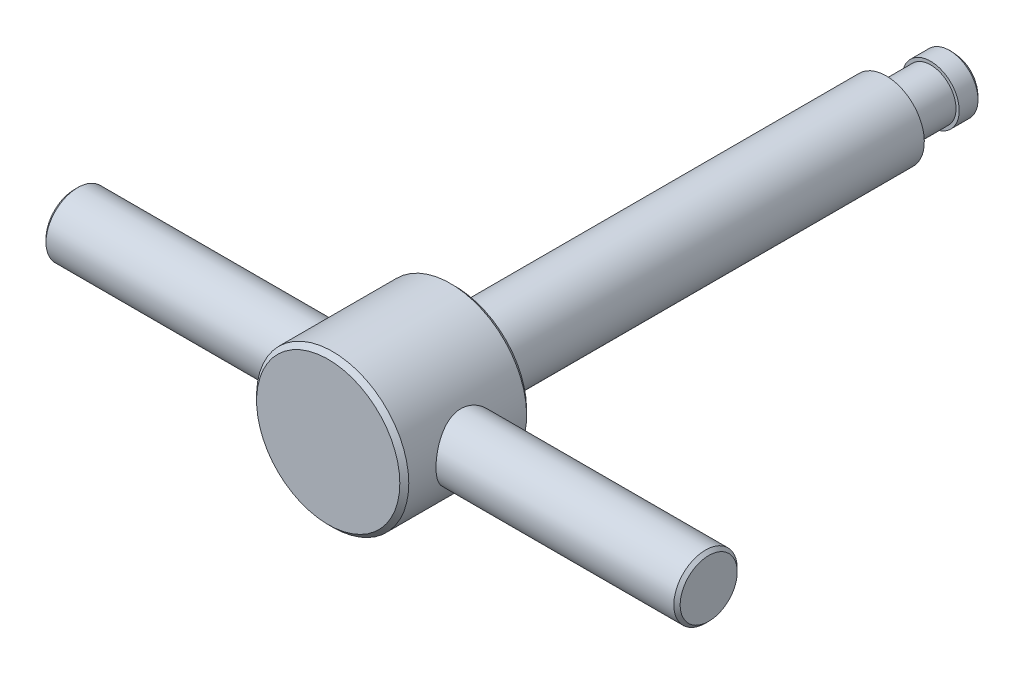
ISO-10303-21;
HEADER;
FILE_DESCRIPTION(('STEP AP214'),'2;1');
FILE_NAME('part.step','',(''),(''),'','','');
FILE_SCHEMA(('AUTOMOTIVE_DESIGN { 1 0 10303 214 1 1 1 1 }'));
ENDSEC;
DATA;
#1=APPLICATION_CONTEXT('core data for automotive mechanical design processes');
#2=APPLICATION_PROTOCOL_DEFINITION('international standard','automotive_design',2000,#1);
#3=PRODUCT_CONTEXT('',#1,'mechanical');
#4=PRODUCT('Part','Part','',(#3));
#5=PRODUCT_RELATED_PRODUCT_CATEGORY('part','',(#4));
#6=PRODUCT_DEFINITION_FORMATION('','',#4);
#7=PRODUCT_DEFINITION_CONTEXT('part definition',#1,'design');
#8=PRODUCT_DEFINITION('design','',#6,#7);
#9=PRODUCT_DEFINITION_SHAPE('','',#8);
#10=(LENGTH_UNIT() NAMED_UNIT(*) SI_UNIT(.MILLI.,.METRE.));
#11=(NAMED_UNIT(*) PLANE_ANGLE_UNIT() SI_UNIT($,.RADIAN.));
#12=(NAMED_UNIT(*) SI_UNIT($,.STERADIAN.) SOLID_ANGLE_UNIT());
#13=UNCERTAINTY_MEASURE_WITH_UNIT(LENGTH_MEASURE(1.E-05),#10,'distance_accuracy_value','');
#14=(GEOMETRIC_REPRESENTATION_CONTEXT(3) GLOBAL_UNCERTAINTY_ASSIGNED_CONTEXT((#13)) GLOBAL_UNIT_ASSIGNED_CONTEXT((#10,
#11,#12)) REPRESENTATION_CONTEXT('',''));
#15=CARTESIAN_POINT('',(0.,0.,0.));
#16=DIRECTION('',(0.,0.,1.));
#17=DIRECTION('',(1.,0.,0.));
#18=AXIS2_PLACEMENT_3D('',#15,#16,#17);
#19=CARTESIAN_POINT('',(25.,0.,47.25));
#20=DIRECTION('',(-1.,0.,0.));
#21=DIRECTION('',(0.,-1.,0.));
#22=AXIS2_PLACEMENT_3D('',#19,#20,#21);
#23=PLANE('',#22);
#24=CARTESIAN_POINT('',(25.0000000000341,0.,45.));
#25=DIRECTION('',(-1.,0.,0.));
#26=DIRECTION('',(0.,-1.,0.));
#27=AXIS2_PLACEMENT_3D('',#24,#25,#26);
#28=CIRCLE('',#27,2.25000000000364);
#29=CARTESIAN_POINT('',(25.0000000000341,-2.25000000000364,45.));
#30=VERTEX_POINT('',#29);
#31=EDGE_CURVE('E15',#30,#30,#28,.T.);
#32=ORIENTED_EDGE('',*,*,#31,.F.);
#33=EDGE_LOOP('',(#32));
#34=FACE_BOUND('',#33,.T.);
#35=ADVANCED_FACE('F12',(#34),#23,.F.);
#36=CARTESIAN_POINT('',(-25.,0.,45.));
#37=DIRECTION('',(1.,0.,0.));
#38=DIRECTION('',(0.,1.,0.));
#39=AXIS2_PLACEMENT_3D('',#36,#37,#38);
#40=PLANE('',#39);
#41=CARTESIAN_POINT('',(-24.9999999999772,0.,45.));
#42=DIRECTION('',(1.,0.,0.));
#43=DIRECTION('',(0.,0.,1.));
#44=AXIS2_PLACEMENT_3D('',#41,#42,#43);
#45=CIRCLE('',#44,2.25000000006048);
#46=CARTESIAN_POINT('',(-24.9999999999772,0.,47.2500000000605));
#47=VERTEX_POINT('',#46);
#48=EDGE_CURVE('E133',#47,#47,#45,.T.);
#49=ORIENTED_EDGE('',*,*,#48,.F.);
#50=EDGE_LOOP('',(#49));
#51=FACE_BOUND('',#50,.T.);
#52=ADVANCED_FACE('F171',(#51),#40,.F.);
#53=CARTESIAN_POINT('',(0.,0.,3.));
#54=DIRECTION('',(-1.,0.,0.));
#55=DIRECTION('',(0.,1.,0.));
#56=AXIS2_PLACEMENT_3D('',#53,#54,#55);
#57=SPHERICAL_SURFACE('',#56,3.);
#58=CARTESIAN_POINT('',(0.,0.,1.01568651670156));
#59=DIRECTION('',(0.,0.,1.));
#60=DIRECTION('',(0.,-1.,0.));
#61=AXIS2_PLACEMENT_3D('',#58,#59,#60);
#62=CIRCLE('',#61,2.25);
#63=CARTESIAN_POINT('',(0.,-2.25,1.01568651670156));
#64=VERTEX_POINT('',#63);
#65=EDGE_CURVE('E126',#64,#64,#62,.T.);
#66=ORIENTED_EDGE('',*,*,#65,.F.);
#67=EDGE_LOOP('',(#66));
#68=FACE_BOUND('',#67,.T.);
#69=ADVANCED_FACE('F168',(#68),#57,.T.);
#70=CARTESIAN_POINT('',(24.7499999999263,0.,45.));
#71=DIRECTION('',(-1.,0.,0.));
#72=DIRECTION('',(0.,-1.,0.));
#73=AXIS2_PLACEMENT_3D('',#70,#71,#72);
#74=CONICAL_SURFACE('',#73,2.50000000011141,0.785398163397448);
#75=CARTESIAN_POINT('',(24.75,0.,45.));
#76=DIRECTION('',(-1.,0.,0.));
#77=DIRECTION('',(0.,-1.,0.));
#78=AXIS2_PLACEMENT_3D('',#75,#76,#77);
#79=CIRCLE('',#78,2.5);
#80=CARTESIAN_POINT('',(24.75,-2.5,45.));
#81=VERTEX_POINT('',#80);
#82=EDGE_CURVE('E124',#81,#81,#79,.T.);
#83=ORIENTED_EDGE('',*,*,#82,.F.);
#84=EDGE_LOOP('',(#83));
#85=FACE_BOUND('',#84,.T.);
#86=ORIENTED_EDGE('',*,*,#31,.T.);
#87=EDGE_LOOP('',(#86));
#88=FACE_BOUND('',#87,.T.);
#89=ADVANCED_FACE('F164',(#85,#88),#74,.T.);
#90=CARTESIAN_POINT('',(0.,0.,50.));
#91=DIRECTION('',(0.,0.,-1.));
#92=DIRECTION('',(0.,1.,0.));
#93=AXIS2_PLACEMENT_3D('',#90,#91,#92);
#94=PLANE('',#93);
#95=CARTESIAN_POINT('',(0.,0.,50.0000000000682));
#96=DIRECTION('',(0.,0.,-1.));
#97=DIRECTION('',(1.,0.,0.));
#98=AXIS2_PLACEMENT_3D('',#95,#96,#97);
#99=CIRCLE('',#98,5.64644660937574);
#100=CARTESIAN_POINT('',(5.64644660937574,0.,50.0000000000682));
#101=VERTEX_POINT('',#100);
#102=EDGE_CURVE('E121',#101,#101,#99,.T.);
#103=ORIENTED_EDGE('',*,*,#102,.F.);
#104=EDGE_LOOP('',(#103));
#105=FACE_BOUND('',#104,.T.);
#106=ADVANCED_FACE('F160',(#105),#94,.F.);
#107=CARTESIAN_POINT('',(-24.7499999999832,0.,45.));
#108=DIRECTION('',(1.,0.,0.));
#109=DIRECTION('',(0.,0.,1.));
#110=AXIS2_PLACEMENT_3D('',#107,#108,#109);
#111=CONICAL_SURFACE('',#110,2.50000000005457,0.785398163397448);
#112=ORIENTED_EDGE('',*,*,#48,.T.);
#113=EDGE_LOOP('',(#112));
#114=FACE_BOUND('',#113,.T.);
#115=CARTESIAN_POINT('',(-24.75,0.,45.));
#116=DIRECTION('',(-1.,0.,0.));
#117=DIRECTION('',(0.,-1.,0.));
#118=AXIS2_PLACEMENT_3D('',#115,#116,#117);
#119=CIRCLE('',#118,2.5);
#120=CARTESIAN_POINT('',(-24.75,-2.5,45.));
#121=VERTEX_POINT('',#120);
#122=EDGE_CURVE('E117',#121,#121,#119,.F.);
#123=ORIENTED_EDGE('',*,*,#122,.F.);
#124=EDGE_LOOP('',(#123));
#125=FACE_BOUND('',#124,.T.);
#126=ADVANCED_FACE('F154',(#114,#125),#111,.T.);
#127=CARTESIAN_POINT('',(0.,0.,0.));
#128=DIRECTION('',(0.,0.,1.));
#129=DIRECTION('',(0.,-1.,0.));
#130=AXIS2_PLACEMENT_3D('',#127,#128,#129);
#131=CYLINDRICAL_SURFACE('',#130,2.25);
#132=CARTESIAN_POINT('',(0.,0.,2.5));
#133=DIRECTION('',(0.,0.,1.));
#134=DIRECTION('',(0.,-1.,0.));
#135=AXIS2_PLACEMENT_3D('',#132,#133,#134);
#136=CIRCLE('',#135,2.25);
#137=CARTESIAN_POINT('',(0.,-2.25,2.5));
#138=VERTEX_POINT('',#137);
#139=EDGE_CURVE('E120',#138,#138,#136,.F.);
#140=ORIENTED_EDGE('',*,*,#139,.T.);
#141=EDGE_LOOP('',(#140));
#142=FACE_BOUND('',#141,.T.);
#143=ORIENTED_EDGE('',*,*,#65,.T.);
#144=EDGE_LOOP('',(#143));
#145=FACE_BOUND('',#144,.T.);
#146=ADVANCED_FACE('F147',(#142,#145),#131,.T.);
#147=CARTESIAN_POINT('',(25.,0.,45.));
#148=DIRECTION('',(-1.,0.,0.));
#149=DIRECTION('',(0.,-1.,0.));
#150=AXIS2_PLACEMENT_3D('',#147,#148,#149);
#151=CYLINDRICAL_SURFACE('',#150,2.5);
#152=CARTESIAN_POINT('',(5.45579342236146,2.49686165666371,44.8747727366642));
#153=CARTESIAN_POINT('',(5.4573407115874,2.49348212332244,44.8074205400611));
#154=CARTESIAN_POINT('',(5.46013427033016,2.48737499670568,44.7402107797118));
#155=CARTESIAN_POINT('',(5.46811434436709,2.46977965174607,44.6066293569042));
#156=CARTESIAN_POINT('',(5.47330241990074,2.45828792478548,44.5402582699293));
#157=CARTESIAN_POINT('',(5.49224376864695,2.41583552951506,44.3428594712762));
#158=CARTESIAN_POINT('',(5.50936824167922,2.37690915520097,44.2137675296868));
#159=CARTESIAN_POINT('',(5.55031554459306,2.27963408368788,43.96507761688));
#160=CARTESIAN_POINT('',(5.57410899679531,2.22137036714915,43.8454408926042));
#161=CARTESIAN_POINT('',(5.6257284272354,2.087184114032,43.6175612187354));
#162=CARTESIAN_POINT('',(5.65355320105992,2.01126684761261,43.5093148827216));
#163=CARTESIAN_POINT('',(5.71212107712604,1.83859984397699,43.3002953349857));
#164=CARTESIAN_POINT('',(5.74293951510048,1.74088566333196,43.2003391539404));
#165=CARTESIAN_POINT('',(5.80272734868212,1.52982934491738,43.0178063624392));
#166=CARTESIAN_POINT('',(5.83169618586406,1.41648251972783,42.9352349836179));
#167=CARTESIAN_POINT('',(5.88545947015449,1.17355076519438,42.78788059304));
#168=CARTESIAN_POINT('',(5.91012490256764,1.04361863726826,42.7236193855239));
#169=CARTESIAN_POINT('',(5.95149690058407,0.773502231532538,42.618261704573));
#170=CARTESIAN_POINT('',(5.96820776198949,0.633323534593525,42.5771527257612));
#171=CARTESIAN_POINT('',(5.9909398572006,0.356053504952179,42.521703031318));
#172=CARTESIAN_POINT('',(5.99756148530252,0.219312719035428,42.5058559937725));
#173=CARTESIAN_POINT('',(6.00131386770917,-0.0550255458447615,42.4968437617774));
#174=CARTESIAN_POINT('',(5.99844751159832,-0.192622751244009,42.5036716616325));
#175=CARTESIAN_POINT('',(5.98393790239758,-0.457365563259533,42.5387520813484));
#176=CARTESIAN_POINT('',(5.97274986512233,-0.584686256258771,42.5658938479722));
#177=CARTESIAN_POINT('',(5.94323412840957,-0.832820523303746,42.639246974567));
#178=CARTESIAN_POINT('',(5.92490555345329,-0.953633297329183,42.6854606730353));
#179=CARTESIAN_POINT('',(5.88219611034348,-1.18934663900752,42.7970564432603));
#180=CARTESIAN_POINT('',(5.85765314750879,-1.30396896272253,42.8629621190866));
#181=CARTESIAN_POINT('',(5.80510670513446,-1.52092619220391,43.0115115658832));
#182=CARTESIAN_POINT('',(5.77710180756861,-1.62325602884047,43.0941622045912));
#183=CARTESIAN_POINT('',(5.71816154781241,-1.82042970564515,43.2807700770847));
#184=CARTESIAN_POINT('',(5.68715988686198,-1.91421389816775,43.3858287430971));
#185=CARTESIAN_POINT('',(5.62748515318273,-2.08313617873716,43.6106412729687));
#186=CARTESIAN_POINT('',(5.5988126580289,-2.158269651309,43.7303987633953));
#187=CARTESIAN_POINT('',(5.54677370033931,-2.2887413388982,43.983972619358));
#188=CARTESIAN_POINT('',(5.52350201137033,-2.34373455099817,44.1179874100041));
#189=CARTESIAN_POINT('',(5.48614157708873,-2.42991688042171,44.3946484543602));
#190=CARTESIAN_POINT('',(5.47204533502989,-2.46112543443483,44.5372875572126));
#191=CARTESIAN_POINT('',(5.45584469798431,-2.49681994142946,44.8154885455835));
#192=CARTESIAN_POINT('',(5.4529112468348,-2.50315453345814,44.9507657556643));
#193=CARTESIAN_POINT('',(5.45714355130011,-2.49391503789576,45.2203941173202));
#194=CARTESIAN_POINT('',(5.46430755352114,-2.47834475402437,45.354745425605));
#195=CARTESIAN_POINT('',(5.48715188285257,-2.42731941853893,45.6119498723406));
#196=CARTESIAN_POINT('',(5.50240078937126,-2.39286895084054,45.735044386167));
#197=CARTESIAN_POINT('',(5.53933217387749,-2.30608126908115,45.9737173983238));
#198=CARTESIAN_POINT('',(5.56101634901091,-2.25373933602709,46.0892939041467));
#199=CARTESIAN_POINT('',(5.60994281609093,-2.12914601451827,46.3170249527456));
#200=CARTESIAN_POINT('',(5.63743552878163,-2.05591142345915,46.4285866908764));
#201=CARTESIAN_POINT('',(5.69422833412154,-1.89293576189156,46.6384323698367));
#202=CARTESIAN_POINT('',(5.72352923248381,-1.80318729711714,46.7367103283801));
#203=CARTESIAN_POINT('',(5.78324662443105,-1.60183297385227,46.9247009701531));
#204=CARTESIAN_POINT('',(5.81358445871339,-1.48909911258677,47.0132361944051));
#205=CARTESIAN_POINT('',(5.86977338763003,-1.24935837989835,47.170165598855));
#206=CARTESIAN_POINT('',(5.89562488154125,-1.12235278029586,47.238561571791));
#207=CARTESIAN_POINT('',(5.93960982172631,-0.859369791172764,47.3519483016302));
#208=CARTESIAN_POINT('',(5.957855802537,-0.723560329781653,47.3972826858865));
#209=CARTESIAN_POINT('',(5.98507884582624,-0.445333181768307,47.4641664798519));
#210=CARTESIAN_POINT('',(5.99406129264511,-0.302919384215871,47.4857297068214));
#211=CARTESIAN_POINT('',(6.00141926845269,-0.0265470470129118,47.5034141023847));
#212=CARTESIAN_POINT('',(6.00050937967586,0.107285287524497,47.5012491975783));
#213=CARTESIAN_POINT('',(5.98989407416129,0.372532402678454,47.4756750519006));
#214=CARTESIAN_POINT('',(5.98018943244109,0.503947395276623,47.4522676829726));
#215=CARTESIAN_POINT('',(5.95328590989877,0.757865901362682,47.3858967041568));
#216=CARTESIAN_POINT('',(5.93625106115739,0.880499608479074,47.3433602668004));
#217=CARTESIAN_POINT('',(5.89634089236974,1.11694067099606,47.2403317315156));
#218=CARTESIAN_POINT('',(5.87346418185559,1.23074591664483,47.1798353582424));
#219=CARTESIAN_POINT('',(5.82254236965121,1.45318208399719,47.0387641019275));
#220=CARTESIAN_POINT('',(5.79428057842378,1.56117318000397,46.9572596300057));
#221=CARTESIAN_POINT('',(5.73626589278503,1.7624540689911,46.7781790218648));
#222=CARTESIAN_POINT('',(5.70651242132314,1.8557381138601,46.6805966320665));
#223=CARTESIAN_POINT('',(5.64665744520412,2.03084981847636,46.4649560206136));
#224=CARTESIAN_POINT('',(5.61664754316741,2.11161682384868,46.346006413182));
#225=CARTESIAN_POINT('',(5.56184611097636,2.25201465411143,46.095042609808));
#226=CARTESIAN_POINT('',(5.53705640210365,2.31163810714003,45.9630238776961));
#227=CARTESIAN_POINT('',(5.49657987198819,2.40629255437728,45.6926166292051));
#228=CARTESIAN_POINT('',(5.48068775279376,2.44188246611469,45.5544588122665));
#229=CARTESIAN_POINT('',(5.46473916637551,2.47724918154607,45.343969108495));
#230=CARTESIAN_POINT('',(5.46073796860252,2.48603523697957,45.2733305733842));
#231=CARTESIAN_POINT('',(5.45548244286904,2.49755101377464,45.1314756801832));
#232=CARTESIAN_POINT('',(5.45422615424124,2.50028505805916,45.060259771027));
#233=CARTESIAN_POINT('',(5.45444241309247,2.49981071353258,44.9509592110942));
#234=CARTESIAN_POINT('',(5.4549188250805,2.498771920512,44.9128432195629));
#235=CARTESIAN_POINT('',(5.45579342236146,2.49686165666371,44.8747727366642));
#236=B_SPLINE_CURVE_WITH_KNOTS('',3,(#152,#153,#154,#155,#156,#157,#158,#159,#160,#161,#162,
#163,#164,#165,#166,#167,#168,#169,#170,#171,#172,#173,#174,#175,#176,#177,#178,#179,#180,#181,
#182,#183,#184,#185,#186,#187,#188,#189,#190,#191,#192,#193,#194,#195,#196,#197,#198,#199,#200,
#201,#202,#203,#204,#205,#206,#207,#208,#209,#210,#211,#212,#213,#214,#215,#216,#217,#218,#219,
#220,#221,#222,#223,#224,#225,#226,#227,#228,#229,#230,#231,#232,#233,#234,#235),.UNSPECIFIED.,
.T.,.F.,(4,2,2,2,2,2,2,2,2,2,2,2,2,2,2,2,2,2,2,2,2,2,2,2,2,2,2,2,2,2,2,2,2,2,2,2,2,2,2,2,2,4),
(0.,0.202330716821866,0.404793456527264,0.810374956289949,1.21419716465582,1.61789897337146,
2.04540544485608,2.47304038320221,2.91186134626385,3.35044505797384,3.76174116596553,
4.17291202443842,4.5631068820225,4.95334959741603,5.3550654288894,5.75694635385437,
6.18758470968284,6.61832952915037,7.05614152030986,7.49359534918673,7.8978428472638,
8.30202015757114,8.68652786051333,9.07113705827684,9.47817972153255,9.88540508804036,
10.3228612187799,10.7602783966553,11.1909715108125,11.6214141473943,12.0209827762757,
12.4205161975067,12.8115394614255,13.202655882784,13.6155254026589,14.0285558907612,
14.4670464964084,14.9056898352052,15.3337443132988,15.547376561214,15.7608561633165,
15.8752225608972),.UNSPECIFIED.);
#237=CARTESIAN_POINT('',(5.45579342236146,2.49686165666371,44.8747727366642));
#238=VERTEX_POINT('',#237);
#239=EDGE_CURVE('E46',#238,#238,#236,.T.);
#240=ORIENTED_EDGE('',*,*,#239,.F.);
#241=EDGE_LOOP('',(#240));
#242=FACE_BOUND('',#241,.T.);
#243=ORIENTED_EDGE('',*,*,#82,.T.);
#244=EDGE_LOOP('',(#243));
#245=FACE_BOUND('',#244,.T.);
#246=ADVANCED_FACE('F145',(#242,#245),#151,.T.);
#247=CARTESIAN_POINT('',(0.,0.,49.6464466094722));
#248=DIRECTION('',(0.,0.,-1.));
#249=DIRECTION('',(1.,0.,0.));
#250=AXIS2_PLACEMENT_3D('',#247,#248,#249);
#251=CONICAL_SURFACE('',#250,5.99999999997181,0.785398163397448);
#252=ORIENTED_EDGE('',*,*,#102,.T.);
#253=EDGE_LOOP('',(#252));
#254=FACE_BOUND('',#253,.T.);
#255=CARTESIAN_POINT('',(0.,0.,49.6464466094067));
#256=DIRECTION('',(0.,0.,1.));
#257=DIRECTION('',(0.,-1.,0.));
#258=AXIS2_PLACEMENT_3D('',#255,#256,#257);
#259=CIRCLE('',#258,6.);
#260=CARTESIAN_POINT('',(0.,-6.,49.6464466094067));
#261=VERTEX_POINT('',#260);
#262=EDGE_CURVE('E45',#261,#261,#259,.F.);
#263=ORIENTED_EDGE('',*,*,#262,.F.);
#264=EDGE_LOOP('',(#263));
#265=FACE_BOUND('',#264,.T.);
#266=ADVANCED_FACE('F72',(#254,#265),#251,.T.);
#267=CARTESIAN_POINT('',(25.,0.,45.));
#268=DIRECTION('',(-1.,0.,0.));
#269=DIRECTION('',(0.,-1.,0.));
#270=AXIS2_PLACEMENT_3D('',#267,#268,#269);
#271=CYLINDRICAL_SURFACE('',#270,2.5);
#272=ORIENTED_EDGE('',*,*,#122,.T.);
#273=EDGE_LOOP('',(#272));
#274=FACE_BOUND('',#273,.T.);
#275=CARTESIAN_POINT('',(-5.45579342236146,2.49686165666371,45.1252272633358));
#276=CARTESIAN_POINT('',(-5.4573407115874,2.49348212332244,45.1925794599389));
#277=CARTESIAN_POINT('',(-5.46013427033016,2.48737499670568,45.2597892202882));
#278=CARTESIAN_POINT('',(-5.46811434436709,2.46977965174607,45.3933706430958));
#279=CARTESIAN_POINT('',(-5.47330241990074,2.45828792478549,45.4597417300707));
#280=CARTESIAN_POINT('',(-5.49224376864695,2.41583552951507,45.6571405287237));
#281=CARTESIAN_POINT('',(-5.50936824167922,2.37690915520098,45.7862324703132));
#282=CARTESIAN_POINT('',(-5.55031554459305,2.27963408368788,46.03492238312));
#283=CARTESIAN_POINT('',(-5.57410899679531,2.22137036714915,46.1545591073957));
#284=CARTESIAN_POINT('',(-5.6257284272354,2.08718411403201,46.3824387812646));
#285=CARTESIAN_POINT('',(-5.65355320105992,2.01126684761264,46.4906851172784));
#286=CARTESIAN_POINT('',(-5.71212107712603,1.83859984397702,46.6997046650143));
#287=CARTESIAN_POINT('',(-5.74293951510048,1.74088566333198,46.7996608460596));
#288=CARTESIAN_POINT('',(-5.80272734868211,1.5298293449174,46.9821936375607));
#289=CARTESIAN_POINT('',(-5.83169618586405,1.41648251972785,47.064765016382));
#290=CARTESIAN_POINT('',(-5.88545947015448,1.17355076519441,47.2121194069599));
#291=CARTESIAN_POINT('',(-5.91012490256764,1.04361863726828,47.2763806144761));
#292=CARTESIAN_POINT('',(-5.95149690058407,0.773502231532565,47.381738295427));
#293=CARTESIAN_POINT('',(-5.96820776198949,0.633323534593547,47.4228472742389));
#294=CARTESIAN_POINT('',(-5.9909398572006,0.356053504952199,47.478296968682));
#295=CARTESIAN_POINT('',(-5.99756148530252,0.219312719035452,47.4941440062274));
#296=CARTESIAN_POINT('',(-6.00131386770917,-0.0550255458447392,47.5031562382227));
#297=CARTESIAN_POINT('',(-5.99844751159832,-0.19262275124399,47.4963283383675));
#298=CARTESIAN_POINT('',(-5.98393790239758,-0.457365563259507,47.4612479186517));
#299=CARTESIAN_POINT('',(-5.97274986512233,-0.584686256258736,47.4341061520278));
#300=CARTESIAN_POINT('',(-5.94323412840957,-0.832820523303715,47.360753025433));
#301=CARTESIAN_POINT('',(-5.9249055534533,-0.953633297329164,47.3145393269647));
#302=CARTESIAN_POINT('',(-5.88219611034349,-1.1893466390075,47.2029435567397));
#303=CARTESIAN_POINT('',(-5.8576531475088,-1.30396896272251,47.1370378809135));
#304=CARTESIAN_POINT('',(-5.80510670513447,-1.52092619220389,46.9884884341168));
#305=CARTESIAN_POINT('',(-5.77710180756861,-1.62325602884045,46.9058377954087));
#306=CARTESIAN_POINT('',(-5.71816154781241,-1.82042970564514,46.7192299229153));
#307=CARTESIAN_POINT('',(-5.68715988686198,-1.91421389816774,46.6141712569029));
#308=CARTESIAN_POINT('',(-5.62748515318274,-2.08313617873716,46.3893587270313));
#309=CARTESIAN_POINT('',(-5.59881265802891,-2.15826965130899,46.2696012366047));
#310=CARTESIAN_POINT('',(-5.54677370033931,-2.2887413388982,46.016027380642));
#311=CARTESIAN_POINT('',(-5.52350201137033,-2.34373455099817,45.8820125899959));
#312=CARTESIAN_POINT('',(-5.48614157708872,-2.42991688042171,45.6053515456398));
#313=CARTESIAN_POINT('',(-5.47204533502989,-2.46112543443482,45.4627124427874));
#314=CARTESIAN_POINT('',(-5.45584469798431,-2.49681994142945,45.1845114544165));
#315=CARTESIAN_POINT('',(-5.4529112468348,-2.50315453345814,45.0492342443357));
#316=CARTESIAN_POINT('',(-5.45714355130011,-2.49391503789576,44.7796058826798));
#317=CARTESIAN_POINT('',(-5.46430755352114,-2.47834475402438,44.645254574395));
#318=CARTESIAN_POINT('',(-5.48715188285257,-2.42731941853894,44.3880501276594));
#319=CARTESIAN_POINT('',(-5.50240078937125,-2.39286895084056,44.264955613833));
#320=CARTESIAN_POINT('',(-5.53933217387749,-2.30608126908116,44.0262826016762));
#321=CARTESIAN_POINT('',(-5.56101634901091,-2.25373933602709,43.9107060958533));
#322=CARTESIAN_POINT('',(-5.60994281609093,-2.12914601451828,43.6829750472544));
#323=CARTESIAN_POINT('',(-5.63743552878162,-2.05591142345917,43.5714133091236));
#324=CARTESIAN_POINT('',(-5.69422833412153,-1.89293576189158,43.3615676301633));
#325=CARTESIAN_POINT('',(-5.72352923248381,-1.80318729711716,43.2632896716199));
#326=CARTESIAN_POINT('',(-5.78324662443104,-1.6018329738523,43.0752990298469));
#327=CARTESIAN_POINT('',(-5.81358445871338,-1.4890991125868,42.9867638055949));
#328=CARTESIAN_POINT('',(-5.86977338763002,-1.24935837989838,42.829834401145));
#329=CARTESIAN_POINT('',(-5.89562488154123,-1.12235278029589,42.7614384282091));
#330=CARTESIAN_POINT('',(-5.93960982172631,-0.859369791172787,42.6480516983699));
#331=CARTESIAN_POINT('',(-5.957855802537,-0.723560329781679,42.6027173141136));
#332=CARTESIAN_POINT('',(-5.98507884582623,-0.445333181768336,42.5358335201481));
#333=CARTESIAN_POINT('',(-5.9940612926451,-0.302919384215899,42.5142702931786));
#334=CARTESIAN_POINT('',(-6.00141926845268,-0.0265470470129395,42.4965858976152));
#335=CARTESIAN_POINT('',(-6.00050937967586,0.107285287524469,42.4987508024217));
#336=CARTESIAN_POINT('',(-5.9898940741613,0.372532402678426,42.5243249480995));
#337=CARTESIAN_POINT('',(-5.9801894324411,0.503947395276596,42.5477323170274));
#338=CARTESIAN_POINT('',(-5.95328590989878,0.757865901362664,42.6141032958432));
#339=CARTESIAN_POINT('',(-5.9362510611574,0.880499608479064,42.6566397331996));
#340=CARTESIAN_POINT('',(-5.89634089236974,1.11694067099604,42.7596682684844));
#341=CARTESIAN_POINT('',(-5.87346418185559,1.23074591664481,42.8201646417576));
#342=CARTESIAN_POINT('',(-5.82254236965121,1.45318208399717,42.9612358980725));
#343=CARTESIAN_POINT('',(-5.79428057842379,1.56117318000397,43.0427403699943));
#344=CARTESIAN_POINT('',(-5.73626589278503,1.76245406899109,43.2218209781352));
#345=CARTESIAN_POINT('',(-5.70651242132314,1.85573811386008,43.3194033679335));
#346=CARTESIAN_POINT('',(-5.64665744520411,2.03084981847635,43.5350439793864));
#347=CARTESIAN_POINT('',(-5.6166475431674,2.11161682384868,43.653993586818));
#348=CARTESIAN_POINT('',(-5.56184611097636,2.25201465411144,43.904957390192));
#349=CARTESIAN_POINT('',(-5.53705640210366,2.31163810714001,44.0369761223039));
#350=CARTESIAN_POINT('',(-5.4965798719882,2.40629255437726,44.307383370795));
#351=CARTESIAN_POINT('',(-5.48068775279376,2.44188246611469,44.4455411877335));
#352=CARTESIAN_POINT('',(-5.46473916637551,2.47724918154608,44.656030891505));
#353=CARTESIAN_POINT('',(-5.46073796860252,2.48603523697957,44.7266694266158));
#354=CARTESIAN_POINT('',(-5.45548244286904,2.49755101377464,44.8685243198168));
#355=CARTESIAN_POINT('',(-5.45422615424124,2.50028505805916,44.9397402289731));
#356=CARTESIAN_POINT('',(-5.45444241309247,2.49981071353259,45.0490407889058));
#357=CARTESIAN_POINT('',(-5.4549188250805,2.49877192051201,45.0871567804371));
#358=CARTESIAN_POINT('',(-5.45579342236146,2.49686165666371,45.1252272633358));
#359=B_SPLINE_CURVE_WITH_KNOTS('',3,(#275,#276,#277,#278,#279,#280,#281,#282,#283,#284,#285,
#286,#287,#288,#289,#290,#291,#292,#293,#294,#295,#296,#297,#298,#299,#300,#301,#302,#303,#304,
#305,#306,#307,#308,#309,#310,#311,#312,#313,#314,#315,#316,#317,#318,#319,#320,#321,#322,#323,
#324,#325,#326,#327,#328,#329,#330,#331,#332,#333,#334,#335,#336,#337,#338,#339,#340,#341,#342,
#343,#344,#345,#346,#347,#348,#349,#350,#351,#352,#353,#354,#355,#356,#357,#358),.UNSPECIFIED.,
.T.,.F.,(4,2,2,2,2,2,2,2,2,2,2,2,2,2,2,2,2,2,2,2,2,2,2,2,2,2,2,2,2,2,2,2,2,2,2,2,2,2,2,2,2,4),
(0.,0.202330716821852,0.404793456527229,0.810374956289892,1.21419716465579,1.61789897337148,
2.04540544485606,2.47304038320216,2.91186134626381,3.35044505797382,3.7617411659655,
4.17291202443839,4.56310688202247,4.953349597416,5.35506542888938,5.75694635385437,
6.18758470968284,6.61832952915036,7.05614152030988,7.49359534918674,7.89784284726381,
8.30202015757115,8.68652786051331,9.07113705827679,9.47817972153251,9.88540508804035,
10.3228612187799,10.7602783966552,11.1909715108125,11.6214141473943,12.0209827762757,
12.4205161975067,12.8115394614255,13.202655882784,13.6155254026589,14.0285558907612,
14.4670464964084,14.9056898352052,15.3337443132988,15.547376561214,15.7608561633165,
15.8752225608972),.UNSPECIFIED.);
#360=CARTESIAN_POINT('',(-5.45579342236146,2.49686165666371,45.1252272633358));
#361=VERTEX_POINT('',#360);
#362=EDGE_CURVE('E37',#361,#361,#359,.T.);
#363=ORIENTED_EDGE('',*,*,#362,.F.);
#364=EDGE_LOOP('',(#363));
#365=FACE_BOUND('',#364,.T.);
#366=ADVANCED_FACE('F52',(#274,#365),#271,.T.);
#367=CARTESIAN_POINT('',(2.,0.,2.5));
#368=DIRECTION('',(0.,0.,-1.));
#369=DIRECTION('',(0.,1.,0.));
#370=AXIS2_PLACEMENT_3D('',#367,#368,#369);
#371=PLANE('',#370);
#372=CARTESIAN_POINT('',(0.,0.,2.5));
#373=DIRECTION('',(0.,0.,1.));
#374=DIRECTION('',(0.,-1.,0.));
#375=AXIS2_PLACEMENT_3D('',#372,#373,#374);
#376=CIRCLE('',#375,2.);
#377=CARTESIAN_POINT('',(0.,-2.,2.5));
#378=VERTEX_POINT('',#377);
#379=EDGE_CURVE('E33',#378,#378,#376,.T.);
#380=ORIENTED_EDGE('',*,*,#379,.F.);
#381=EDGE_LOOP('',(#380));
#382=FACE_BOUND('',#381,.T.);
#383=ORIENTED_EDGE('',*,*,#139,.F.);
#384=EDGE_LOOP('',(#383));
#385=FACE_BOUND('',#384,.T.);
#386=ADVANCED_FACE('F61',(#382,#385),#371,.F.);
#387=CARTESIAN_POINT('',(0.,0.,0.));
#388=DIRECTION('',(0.,0.,1.));
#389=DIRECTION('',(0.,-1.,0.));
#390=AXIS2_PLACEMENT_3D('',#387,#388,#389);
#391=CYLINDRICAL_SURFACE('',#390,6.);
#392=ORIENTED_EDGE('',*,*,#362,.T.);
#393=EDGE_LOOP('',(#392));
#394=FACE_BOUND('',#393,.T.);
#395=ORIENTED_EDGE('',*,*,#262,.T.);
#396=EDGE_LOOP('',(#395));
#397=FACE_BOUND('',#396,.T.);
#398=ORIENTED_EDGE('',*,*,#239,.T.);
#399=EDGE_LOOP('',(#398));
#400=FACE_BOUND('',#399,.T.);
#401=CARTESIAN_POINT('',(0.,0.,40.3535533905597));
#402=DIRECTION('',(0.,0.,1.));
#403=DIRECTION('',(0.,-1.,0.));
#404=AXIS2_PLACEMENT_3D('',#401,#402,#403);
#405=CIRCLE('',#404,5.99999999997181);
#406=CARTESIAN_POINT('',(0.,-5.99999999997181,40.3535533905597));
#407=VERTEX_POINT('',#406);
#408=EDGE_CURVE('E36',#407,#407,#405,.F.);
#409=ORIENTED_EDGE('',*,*,#408,.F.);
#410=EDGE_LOOP('',(#409));
#411=FACE_BOUND('',#410,.T.);
#412=ADVANCED_FACE('F56',(#394,#397,#400,#411),#391,.T.);
#413=CARTESIAN_POINT('',(0.,0.,0.));
#414=DIRECTION('',(0.,0.,1.));
#415=DIRECTION('',(0.,-1.,0.));
#416=AXIS2_PLACEMENT_3D('',#413,#414,#415);
#417=CYLINDRICAL_SURFACE('',#416,2.);
#418=CARTESIAN_POINT('',(0.,0.,5.42264973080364));
#419=DIRECTION('',(0.,0.,1.));
#420=DIRECTION('',(0.,-1.,0.));
#421=AXIS2_PLACEMENT_3D('',#418,#419,#420);
#422=CIRCLE('',#421,2.00000000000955);
#423=CARTESIAN_POINT('',(0.,-2.00000000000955,5.42264973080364));
#424=VERTEX_POINT('',#423);
#425=EDGE_CURVE('E32',#424,#424,#422,.T.);
#426=ORIENTED_EDGE('',*,*,#425,.F.);
#427=EDGE_LOOP('',(#426));
#428=FACE_BOUND('',#427,.T.);
#429=ORIENTED_EDGE('',*,*,#379,.T.);
#430=EDGE_LOOP('',(#429));
#431=FACE_BOUND('',#430,.T.);
#432=ADVANCED_FACE('F60',(#428,#431),#417,.T.);
#433=CARTESIAN_POINT('',(0.,0.,40.3535533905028));
#434=DIRECTION('',(0.,0.,1.));
#435=DIRECTION('',(0.,-1.,0.));
#436=AXIS2_PLACEMENT_3D('',#433,#434,#435);
#437=CONICAL_SURFACE('',#436,5.99999999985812,0.785398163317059);
#438=ORIENTED_EDGE('',*,*,#408,.T.);
#439=EDGE_LOOP('',(#438));
#440=FACE_BOUND('',#439,.T.);
#441=CARTESIAN_POINT('',(0.,0.,39.9999999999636));
#442=DIRECTION('',(0.,0.,1.));
#443=DIRECTION('',(0.,-1.,0.));
#444=AXIS2_PLACEMENT_3D('',#441,#442,#443);
#445=CIRCLE('',#444,5.64644660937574);
#446=CARTESIAN_POINT('',(0.,-5.64644660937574,39.9999999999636));
#447=VERTEX_POINT('',#446);
#448=EDGE_CURVE('E24',#447,#447,#445,.T.);
#449=ORIENTED_EDGE('',*,*,#448,.T.);
#450=EDGE_LOOP('',(#449));
#451=FACE_BOUND('',#450,.T.);
#452=ADVANCED_FACE('F90',(#440,#451),#437,.T.);
#453=CARTESIAN_POINT('',(0.,0.,5.99999999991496));
#454=DIRECTION('',(0.,0.,1.));
#455=DIRECTION('',(-1.,0.,0.));
#456=AXIS2_PLACEMENT_3D('',#453,#454,#455);
#457=CONICAL_SURFACE('',#456,2.99999999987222,1.04719755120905);
#458=CARTESIAN_POINT('',(0.,0.,6.));
#459=DIRECTION('',(0.,0.,1.));
#460=DIRECTION('',(0.,-1.,0.));
#461=AXIS2_PLACEMENT_3D('',#458,#459,#460);
#462=CIRCLE('',#461,3.);
#463=CARTESIAN_POINT('',(0.,-3.,6.));
#464=VERTEX_POINT('',#463);
#465=EDGE_CURVE('E19',#464,#464,#462,.T.);
#466=ORIENTED_EDGE('',*,*,#465,.F.);
#467=EDGE_LOOP('',(#466));
#468=FACE_BOUND('',#467,.T.);
#469=ORIENTED_EDGE('',*,*,#425,.T.);
#470=EDGE_LOOP('',(#469));
#471=FACE_BOUND('',#470,.T.);
#472=ADVANCED_FACE('F84',(#468,#471),#457,.T.);
#473=CARTESIAN_POINT('',(5.64644660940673,0.,40.));
#474=DIRECTION('',(0.,0.,1.));
#475=DIRECTION('',(0.,-1.,0.));
#476=AXIS2_PLACEMENT_3D('',#473,#474,#475);
#477=PLANE('',#476);
#478=ORIENTED_EDGE('',*,*,#448,.F.);
#479=EDGE_LOOP('',(#478));
#480=FACE_BOUND('',#479,.T.);
#481=CARTESIAN_POINT('',(0.,0.,40.));
#482=DIRECTION('',(0.,0.,1.));
#483=DIRECTION('',(0.,-1.,0.));
#484=AXIS2_PLACEMENT_3D('',#481,#482,#483);
#485=CIRCLE('',#484,3.);
#486=CARTESIAN_POINT('',(0.,-3.,40.));
#487=VERTEX_POINT('',#486);
#488=EDGE_CURVE('E8',#487,#487,#485,.F.);
#489=ORIENTED_EDGE('',*,*,#488,.F.);
#490=EDGE_LOOP('',(#489));
#491=FACE_BOUND('',#490,.T.);
#492=ADVANCED_FACE('F78',(#480,#491),#477,.F.);
#493=CARTESIAN_POINT('',(0.,0.,0.));
#494=DIRECTION('',(0.,0.,1.));
#495=DIRECTION('',(0.,-1.,0.));
#496=AXIS2_PLACEMENT_3D('',#493,#494,#495);
#497=CYLINDRICAL_SURFACE('',#496,3.);
#498=ORIENTED_EDGE('',*,*,#488,.T.);
#499=EDGE_LOOP('',(#498));
#500=FACE_BOUND('',#499,.T.);
#501=ORIENTED_EDGE('',*,*,#465,.T.);
#502=EDGE_LOOP('',(#501));
#503=FACE_BOUND('',#502,.T.);
#504=ADVANCED_FACE('F76',(#500,#503),#497,.T.);
#505=CLOSED_SHELL('',(#35,#52,#69,#89,#106,#126,#146,#246,#266,#366,#386,#412,#432,#452,#472,
#492,#504));
#506=MANIFOLD_SOLID_BREP('B1',#505);
#507=ADVANCED_BREP_SHAPE_REPRESENTATION('',(#18,#506),#14);
#508=SHAPE_DEFINITION_REPRESENTATION(#9,#507);
ENDSEC;
END-ISO-10303-21;
